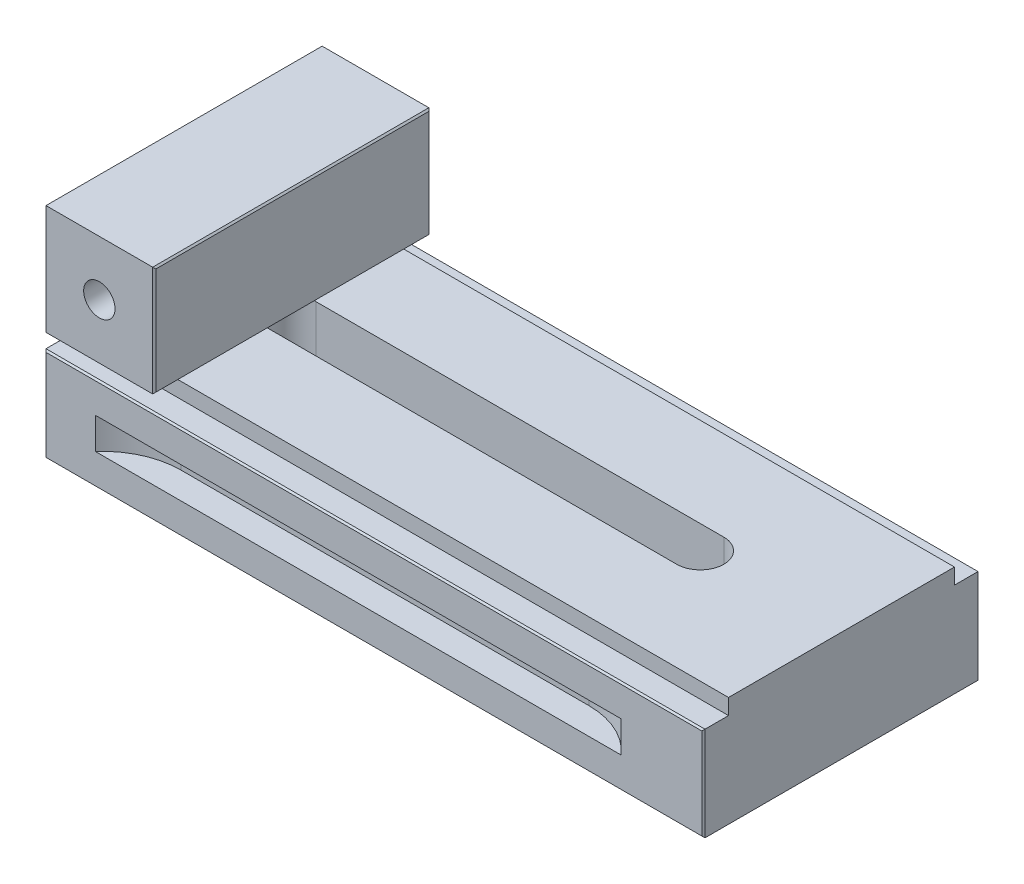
from build123d import *

# Parameters (mm, degrees)
ESQUISSE1_W             = 35
ESQUISSE1_H             = 35
EXTRUSION1_DEPTH        = 44
CHANFREIN1_SIZE         = 0.5
ESQUISSE2_R             = 5
ENL_V_MAT_EXTRU_1_DEPTH = 101.965340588
EXTRUSION2_DEPTH        = 210
ENL_V_MAT_EXTRU_2_DEPTH = 184.809684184
CHANFREIN2_SIZE         = 0.5
ENL_V_MAT_EXTRU_4_DEPTH = 10


with BuildPart() as part:
    # Esquisse1 → Extrusion1 (new, symmetric)
    with BuildSketch(Plane.XY):
        with Locations((-17.5, -17.5)):
            Rectangle(ESQUISSE1_W, ESQUISSE1_H)
    extrude(amount=EXTRUSION1_DEPTH, both=True)

    # Chanfrein1
    chanfrein1_edges = [part.edges().sort_by_distance(p)[0] for p in [
        (-35, -17.5, 44),
        (0, -17.5, 44),
        (-35, -17.5, -44),
        (0, -17.5, -44),
        (0, -35, 0),
        (-35, -35, 0),
        (-35, 0, 0),
        (0, 0, 0),
    ]]
    chamfer(chanfrein1_edges, length=CHANFREIN1_SIZE)

    # Esquisse2 → Enl_v. mat.-Extru.1 (cut, through all)
    with BuildSketch(Plane.XY.offset(44)):
        with Locations((-17.5, -17.5)):
            Circle(ESQUISSE2_R)
    extrude(amount=-ENL_V_MAT_EXTRU_1_DEPTH, mode=Mode.SUBTRACT)

    # Esquisse3 → Extrusion2 (add)
    with BuildSketch(Plane.ZY.offset(35)):
        Polygon((-36, -35), (36, -35), (36, -40), (44, -40), (44, -70), (-44, -70), (-44, -40), (-36, -40), align=None)
    extrude(amount=-EXTRUSION2_DEPTH)

    # Esquisse4 → Enl_v. mat.-Extru.2 (cut, through all)
    with BuildSketch(Plane(origin=(0, -35, 0), x_dir=(-1, 0, 0), z_dir=(0, 1, 0))):
        with BuildLine():
            Line((0, -7.5), (-130, -7.5))
            ThreePointArc((-130, -7.5), (-137.5, 0), (-130, 7.5))
            Line((-130, 7.5), (0, 7.5))
            ThreePointArc((0, 7.5), (7.5, 0), (0, -7.5))
        make_face()
    extrude(amount=-ENL_V_MAT_EXTRU_2_DEPTH, mode=Mode.SUBTRACT)

    # Chanfrein2
    chanfrein2_edges = [part.edges().sort_by_distance(p)[0] for p in [
        (175, -55, 44),
        (70, -40, 44),
        (70, -70, 44),
        (175, -55, -44),
        (70, -70, -44),
        (70, -40, -44),
        (-35, -55, -44),
        (-35, -55, 44),
    ]]
    chamfer(chanfrein2_edges, length=CHANFREIN2_SIZE)

    # Esquisse6 → Enl_v. mat.-Extru.4 (cut)
    with BuildSketch(Plane.XZ.offset(60)):
        with BuildLine():
            Line((0, 35.5), (130, 35.5))
            ThreePointArc((130, 35.5), (155, 60.5), (130, 85.5))
            Line((130, 85.5), (0, 85.5))
            ThreePointArc((0, 85.5), (-25, 60.5), (0, 35.5))
        make_face()
    enl_v_mat_extru_4 = extrude(amount=-ENL_V_MAT_EXTRU_4_DEPTH, mode=Mode.SUBTRACT)

    # Sym_trie1: Enl_v. mat.-Extru.4 across plane
    add(enl_v_mat_extru_4.mirror(Plane.XY), mode=Mode.SUBTRACT)


solid = part.part
